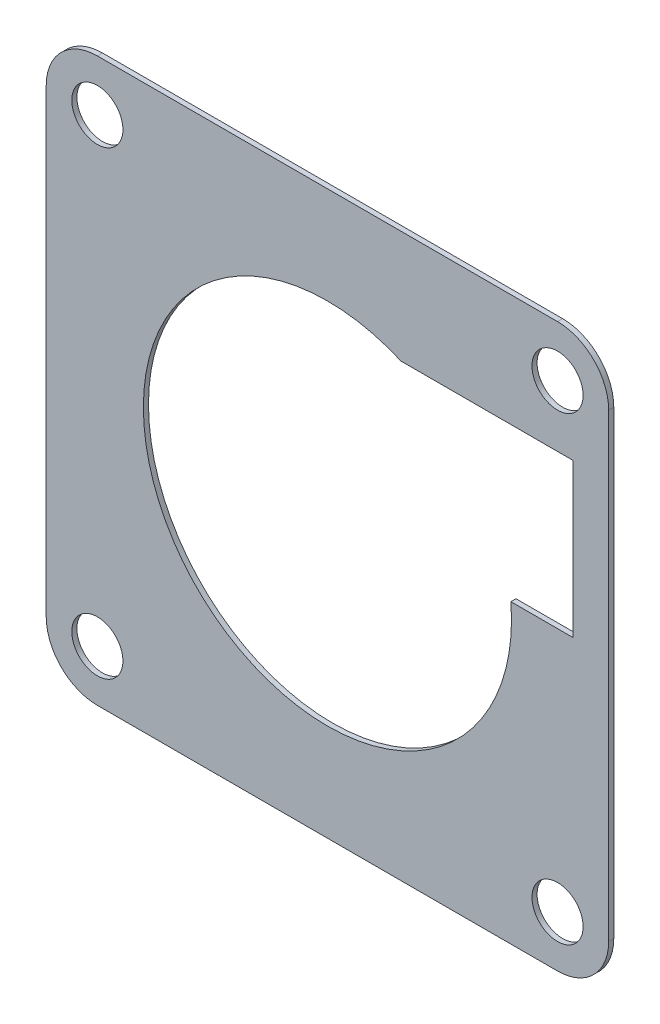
ISO-10303-21;
HEADER;
FILE_DESCRIPTION(('STEP AP214'),'2;1');
FILE_NAME('part.step','',(''),(''),'','','');
FILE_SCHEMA(('AUTOMOTIVE_DESIGN { 1 0 10303 214 1 1 1 1 }'));
ENDSEC;
DATA;
#1=APPLICATION_CONTEXT('core data for automotive mechanical design processes');
#2=APPLICATION_PROTOCOL_DEFINITION('international standard','automotive_design',2000,#1);
#3=PRODUCT_CONTEXT('',#1,'mechanical');
#4=PRODUCT('Part','Part','',(#3));
#5=PRODUCT_RELATED_PRODUCT_CATEGORY('part','',(#4));
#6=PRODUCT_DEFINITION_FORMATION('','',#4);
#7=PRODUCT_DEFINITION_CONTEXT('part definition',#1,'design');
#8=PRODUCT_DEFINITION('design','',#6,#7);
#9=PRODUCT_DEFINITION_SHAPE('','',#8);
#10=(LENGTH_UNIT() NAMED_UNIT(*) SI_UNIT(.MILLI.,.METRE.));
#11=(NAMED_UNIT(*) PLANE_ANGLE_UNIT() SI_UNIT($,.RADIAN.));
#12=(NAMED_UNIT(*) SI_UNIT($,.STERADIAN.) SOLID_ANGLE_UNIT());
#13=UNCERTAINTY_MEASURE_WITH_UNIT(LENGTH_MEASURE(1.E-05),#10,'distance_accuracy_value','');
#14=(GEOMETRIC_REPRESENTATION_CONTEXT(3) GLOBAL_UNCERTAINTY_ASSIGNED_CONTEXT((#13)) GLOBAL_UNIT_ASSIGNED_CONTEXT((#10,
#11,#12)) REPRESENTATION_CONTEXT('',''));
#15=CARTESIAN_POINT('',(0.,0.,0.));
#16=DIRECTION('',(0.,0.,1.));
#17=DIRECTION('',(1.,0.,0.));
#18=AXIS2_PLACEMENT_3D('',#15,#16,#17);
#19=CARTESIAN_POINT('',(-27.5,27.5,0.5));
#20=DIRECTION('',(1.,0.,0.));
#21=DIRECTION('',(0.,1.,0.));
#22=AXIS2_PLACEMENT_3D('',#19,#20,#21);
#23=PLANE('',#22);
#24=DIRECTION('',(0.,-1.,0.));
#25=VECTOR('',#24,1.);
#26=CARTESIAN_POINT('',(-27.5,27.5,0.5));
#27=LINE('',#26,#25);
#28=CARTESIAN_POINT('',(-27.5,22.5,0.5));
#29=VERTEX_POINT('',#28);
#30=CARTESIAN_POINT('',(-27.5,-22.5,0.5));
#31=VERTEX_POINT('',#30);
#32=EDGE_CURVE('E188',#29,#31,#27,.T.);
#33=ORIENTED_EDGE('',*,*,#32,.F.);
#34=DIRECTION('',(0.,0.,-1.));
#35=VECTOR('',#34,1.);
#36=CARTESIAN_POINT('',(-27.5,22.5,0.5));
#37=LINE('',#36,#35);
#38=CARTESIAN_POINT('',(-27.5,22.5,0.));
#39=VERTEX_POINT('',#38);
#40=EDGE_CURVE('E202',#29,#39,#37,.T.);
#41=ORIENTED_EDGE('',*,*,#40,.T.);
#42=DIRECTION('',(0.,-1.,0.));
#43=VECTOR('',#42,1.);
#44=CARTESIAN_POINT('',(-27.5,27.5,0.));
#45=LINE('',#44,#43);
#46=CARTESIAN_POINT('',(-27.5,-22.5,0.));
#47=VERTEX_POINT('',#46);
#48=EDGE_CURVE('E176',#39,#47,#45,.T.);
#49=ORIENTED_EDGE('',*,*,#48,.T.);
#50=DIRECTION('',(0.,0.,-1.));
#51=VECTOR('',#50,1.);
#52=CARTESIAN_POINT('',(-27.5,-22.5,0.5));
#53=LINE('',#52,#51);
#54=EDGE_CURVE('E200',#47,#31,#53,.F.);
#55=ORIENTED_EDGE('',*,*,#54,.T.);
#56=EDGE_LOOP('',(#33,#41,#49,#55));
#57=FACE_BOUND('',#56,.T.);
#58=ADVANCED_FACE('F29',(#57),#23,.F.);
#59=CARTESIAN_POINT('',(-27.5,-27.5,0.5));
#60=DIRECTION('',(0.,1.,0.));
#61=DIRECTION('',(0.,0.,1.));
#62=AXIS2_PLACEMENT_3D('',#59,#60,#61);
#63=PLANE('',#62);
#64=DIRECTION('',(1.,0.,0.));
#65=VECTOR('',#64,1.);
#66=CARTESIAN_POINT('',(-27.5,-27.5,0.));
#67=LINE('',#66,#65);
#68=CARTESIAN_POINT('',(-22.5,-27.5,0.));
#69=VERTEX_POINT('',#68);
#70=CARTESIAN_POINT('',(22.5,-27.5,0.));
#71=VERTEX_POINT('',#70);
#72=EDGE_CURVE('E179',#69,#71,#67,.T.);
#73=ORIENTED_EDGE('',*,*,#72,.T.);
#74=DIRECTION('',(0.,0.,-1.));
#75=VECTOR('',#74,1.);
#76=CARTESIAN_POINT('',(22.5,-27.5,0.5));
#77=LINE('',#76,#75);
#78=CARTESIAN_POINT('',(22.5,-27.5,0.5));
#79=VERTEX_POINT('',#78);
#80=EDGE_CURVE('E11',#71,#79,#77,.F.);
#81=ORIENTED_EDGE('',*,*,#80,.T.);
#82=DIRECTION('',(1.,0.,0.));
#83=VECTOR('',#82,1.);
#84=CARTESIAN_POINT('',(-27.5,-27.5,0.5));
#85=LINE('',#84,#83);
#86=CARTESIAN_POINT('',(-22.5,-27.5,0.5));
#87=VERTEX_POINT('',#86);
#88=EDGE_CURVE('E191',#87,#79,#85,.T.);
#89=ORIENTED_EDGE('',*,*,#88,.F.);
#90=DIRECTION('',(0.,0.,-1.));
#91=VECTOR('',#90,1.);
#92=CARTESIAN_POINT('',(-22.5,-27.5,0.5));
#93=LINE('',#92,#91);
#94=EDGE_CURVE('E36',#87,#69,#93,.T.);
#95=ORIENTED_EDGE('',*,*,#94,.T.);
#96=EDGE_LOOP('',(#73,#81,#89,#95));
#97=FACE_BOUND('',#96,.T.);
#98=ADVANCED_FACE('F235',(#97),#63,.F.);
#99=CARTESIAN_POINT('',(27.5,27.5,0.5));
#100=DIRECTION('',(-1.,0.,0.));
#101=DIRECTION('',(0.,-1.,0.));
#102=AXIS2_PLACEMENT_3D('',#99,#100,#101);
#103=PLANE('',#102);
#104=DIRECTION('',(0.,1.,0.));
#105=VECTOR('',#104,1.);
#106=CARTESIAN_POINT('',(27.5,27.5,0.));
#107=LINE('',#106,#105);
#108=CARTESIAN_POINT('',(27.5,-22.5,0.));
#109=VERTEX_POINT('',#108);
#110=CARTESIAN_POINT('',(27.5,22.5,0.));
#111=VERTEX_POINT('',#110);
#112=EDGE_CURVE('E182',#109,#111,#107,.T.);
#113=ORIENTED_EDGE('',*,*,#112,.T.);
#114=DIRECTION('',(0.,0.,-1.));
#115=VECTOR('',#114,1.);
#116=CARTESIAN_POINT('',(27.5,22.5,0.5));
#117=LINE('',#116,#115);
#118=CARTESIAN_POINT('',(27.5,22.5,0.5));
#119=VERTEX_POINT('',#118);
#120=EDGE_CURVE('E229',#111,#119,#117,.F.);
#121=ORIENTED_EDGE('',*,*,#120,.T.);
#122=DIRECTION('',(0.,1.,0.));
#123=VECTOR('',#122,1.);
#124=CARTESIAN_POINT('',(27.5,27.5,0.5));
#125=LINE('',#124,#123);
#126=CARTESIAN_POINT('',(27.5,-22.5,0.5));
#127=VERTEX_POINT('',#126);
#128=EDGE_CURVE('E194',#127,#119,#125,.T.);
#129=ORIENTED_EDGE('',*,*,#128,.F.);
#130=DIRECTION('',(0.,0.,-1.));
#131=VECTOR('',#130,1.);
#132=CARTESIAN_POINT('',(27.5,-22.5,0.5));
#133=LINE('',#132,#131);
#134=EDGE_CURVE('E226',#127,#109,#133,.T.);
#135=ORIENTED_EDGE('',*,*,#134,.T.);
#136=EDGE_LOOP('',(#113,#121,#129,#135));
#137=FACE_BOUND('',#136,.T.);
#138=ADVANCED_FACE('F249',(#137),#103,.F.);
#139=CARTESIAN_POINT('',(-27.5,27.5,0.5));
#140=DIRECTION('',(0.,-1.,0.));
#141=DIRECTION('',(0.,0.,-1.));
#142=AXIS2_PLACEMENT_3D('',#139,#140,#141);
#143=PLANE('',#142);
#144=DIRECTION('',(-1.,0.,0.));
#145=VECTOR('',#144,1.);
#146=CARTESIAN_POINT('',(-27.5,27.5,0.));
#147=LINE('',#146,#145);
#148=CARTESIAN_POINT('',(22.5,27.5,0.));
#149=VERTEX_POINT('',#148);
#150=CARTESIAN_POINT('',(-22.5,27.5,0.));
#151=VERTEX_POINT('',#150);
#152=EDGE_CURVE('E185',#149,#151,#147,.T.);
#153=ORIENTED_EDGE('',*,*,#152,.T.);
#154=DIRECTION('',(0.,0.,-1.));
#155=VECTOR('',#154,1.);
#156=CARTESIAN_POINT('',(-22.5,27.5,0.5));
#157=LINE('',#156,#155);
#158=CARTESIAN_POINT('',(-22.5,27.5,0.5));
#159=VERTEX_POINT('',#158);
#160=EDGE_CURVE('E216',#151,#159,#157,.F.);
#161=ORIENTED_EDGE('',*,*,#160,.T.);
#162=DIRECTION('',(-1.,0.,0.));
#163=VECTOR('',#162,1.);
#164=CARTESIAN_POINT('',(-27.5,27.5,0.5));
#165=LINE('',#164,#163);
#166=CARTESIAN_POINT('',(22.5,27.5,0.5));
#167=VERTEX_POINT('',#166);
#168=EDGE_CURVE('E197',#167,#159,#165,.T.);
#169=ORIENTED_EDGE('',*,*,#168,.F.);
#170=DIRECTION('',(0.,0.,-1.));
#171=VECTOR('',#170,1.);
#172=CARTESIAN_POINT('',(22.5,27.5,0.5));
#173=LINE('',#172,#171);
#174=EDGE_CURVE('E213',#167,#149,#173,.T.);
#175=ORIENTED_EDGE('',*,*,#174,.T.);
#176=EDGE_LOOP('',(#153,#161,#169,#175));
#177=FACE_BOUND('',#176,.T.);
#178=ADVANCED_FACE('F259',(#177),#143,.F.);
#179=CARTESIAN_POINT('',(-27.5,-27.5,0.5));
#180=DIRECTION('',(0.,0.,1.));
#181=DIRECTION('',(1.,0.,0.));
#182=AXIS2_PLACEMENT_3D('',#179,#180,#181);
#183=PLANE('',#182);
#184=CARTESIAN_POINT('',(0.,0.,0.5));
#185=DIRECTION('',(0.,0.,1.));
#186=DIRECTION('',(1.,0.,0.));
#187=AXIS2_PLACEMENT_3D('',#184,#185,#186);
#188=CIRCLE('',#187,18.);
#189=CARTESIAN_POINT('',(7.19374728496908,16.5,0.5));
#190=VERTEX_POINT('',#189);
#191=CARTESIAN_POINT('',(17.9373911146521,1.5,0.5));
#192=VERTEX_POINT('',#191);
#193=EDGE_CURVE('E43',#190,#192,#188,.T.);
#194=ORIENTED_EDGE('',*,*,#193,.F.);
#195=DIRECTION('',(-1.,0.,0.));
#196=VECTOR('',#195,1.);
#197=CARTESIAN_POINT('',(7.19374728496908,16.5,0.5));
#198=LINE('',#197,#196);
#199=CARTESIAN_POINT('',(24.,16.5,0.5));
#200=VERTEX_POINT('',#199);
#201=EDGE_CURVE('E134',#200,#190,#198,.T.);
#202=ORIENTED_EDGE('',*,*,#201,.F.);
#203=DIRECTION('',(0.,1.,0.));
#204=VECTOR('',#203,1.);
#205=CARTESIAN_POINT('',(24.,16.5,0.5));
#206=LINE('',#205,#204);
#207=CARTESIAN_POINT('',(24.,1.5,0.5));
#208=VERTEX_POINT('',#207);
#209=EDGE_CURVE('E118',#208,#200,#206,.T.);
#210=ORIENTED_EDGE('',*,*,#209,.F.);
#211=DIRECTION('',(1.,0.,0.));
#212=VECTOR('',#211,1.);
#213=CARTESIAN_POINT('',(24.,1.5,0.5));
#214=LINE('',#213,#212);
#215=EDGE_CURVE('E127',#192,#208,#214,.T.);
#216=ORIENTED_EDGE('',*,*,#215,.F.);
#217=EDGE_LOOP('',(#194,#202,#210,#216));
#218=FACE_BOUND('',#217,.T.);
#219=CARTESIAN_POINT('',(-22.5,-22.5,0.5));
#220=DIRECTION('',(0.,0.,1.));
#221=DIRECTION('',(-1.,0.,0.));
#222=AXIS2_PLACEMENT_3D('',#219,#220,#221);
#223=CIRCLE('',#222,2.5);
#224=CARTESIAN_POINT('',(-25.,-22.5,0.5));
#225=VERTEX_POINT('',#224);
#226=EDGE_CURVE('E150',#225,#225,#223,.T.);
#227=ORIENTED_EDGE('',*,*,#226,.F.);
#228=EDGE_LOOP('',(#227));
#229=FACE_BOUND('',#228,.T.);
#230=CARTESIAN_POINT('',(22.5,-22.5,0.5));
#231=DIRECTION('',(0.,0.,1.));
#232=DIRECTION('',(1.,0.,0.));
#233=AXIS2_PLACEMENT_3D('',#230,#231,#232);
#234=CIRCLE('',#233,2.5);
#235=CARTESIAN_POINT('',(25.,-22.5,0.5));
#236=VERTEX_POINT('',#235);
#237=EDGE_CURVE('E158',#236,#236,#234,.T.);
#238=ORIENTED_EDGE('',*,*,#237,.F.);
#239=EDGE_LOOP('',(#238));
#240=FACE_BOUND('',#239,.T.);
#241=CARTESIAN_POINT('',(22.5,22.5,0.5));
#242=DIRECTION('',(0.,0.,1.));
#243=DIRECTION('',(-1.,0.,0.));
#244=AXIS2_PLACEMENT_3D('',#241,#242,#243);
#245=CIRCLE('',#244,2.5);
#246=CARTESIAN_POINT('',(20.,22.5,0.5));
#247=VERTEX_POINT('',#246);
#248=EDGE_CURVE('E164',#247,#247,#245,.T.);
#249=ORIENTED_EDGE('',*,*,#248,.F.);
#250=EDGE_LOOP('',(#249));
#251=FACE_BOUND('',#250,.T.);
#252=CARTESIAN_POINT('',(-22.5,22.5,0.5));
#253=DIRECTION('',(0.,0.,1.));
#254=DIRECTION('',(1.,0.,0.));
#255=AXIS2_PLACEMENT_3D('',#252,#253,#254);
#256=CIRCLE('',#255,2.5);
#257=CARTESIAN_POINT('',(-20.,22.5,0.5));
#258=VERTEX_POINT('',#257);
#259=EDGE_CURVE('E170',#258,#258,#256,.T.);
#260=ORIENTED_EDGE('',*,*,#259,.F.);
#261=EDGE_LOOP('',(#260));
#262=FACE_BOUND('',#261,.T.);
#263=ORIENTED_EDGE('',*,*,#168,.T.);
#264=CARTESIAN_POINT('',(-22.5,22.5,0.5));
#265=DIRECTION('',(0.,0.,1.));
#266=DIRECTION('',(1.,0.,0.));
#267=AXIS2_PLACEMENT_3D('',#264,#265,#266);
#268=CIRCLE('',#267,5.);
#269=EDGE_CURVE('E224',#159,#29,#268,.T.);
#270=ORIENTED_EDGE('',*,*,#269,.T.);
#271=ORIENTED_EDGE('',*,*,#32,.T.);
#272=CARTESIAN_POINT('',(-22.5,-22.5,0.5));
#273=DIRECTION('',(0.,0.,1.));
#274=DIRECTION('',(1.,0.,0.));
#275=AXIS2_PLACEMENT_3D('',#272,#273,#274);
#276=CIRCLE('',#275,5.);
#277=EDGE_CURVE('E218',#31,#87,#276,.T.);
#278=ORIENTED_EDGE('',*,*,#277,.T.);
#279=ORIENTED_EDGE('',*,*,#88,.T.);
#280=CARTESIAN_POINT('',(22.5,-22.5,0.5));
#281=DIRECTION('',(0.,0.,1.));
#282=DIRECTION('',(1.,0.,0.));
#283=AXIS2_PLACEMENT_3D('',#280,#281,#282);
#284=CIRCLE('',#283,5.);
#285=EDGE_CURVE('E220',#79,#127,#284,.T.);
#286=ORIENTED_EDGE('',*,*,#285,.T.);
#287=ORIENTED_EDGE('',*,*,#128,.T.);
#288=CARTESIAN_POINT('',(22.5,22.5,0.5));
#289=DIRECTION('',(0.,0.,1.));
#290=DIRECTION('',(1.,0.,0.));
#291=AXIS2_PLACEMENT_3D('',#288,#289,#290);
#292=CIRCLE('',#291,5.);
#293=EDGE_CURVE('E222',#119,#167,#292,.T.);
#294=ORIENTED_EDGE('',*,*,#293,.T.);
#295=EDGE_LOOP('',(#263,#270,#271,#278,#279,#286,#287,#294));
#296=FACE_BOUND('',#295,.T.);
#297=ADVANCED_FACE('F131',(#218,#229,#240,#251,#262,#296),#183,.T.);
#298=CARTESIAN_POINT('',(-27.5,-27.5,0.));
#299=DIRECTION('',(0.,0.,1.));
#300=DIRECTION('',(1.,0.,0.));
#301=AXIS2_PLACEMENT_3D('',#298,#299,#300);
#302=PLANE('',#301);
#303=DIRECTION('',(-1.,0.,0.));
#304=VECTOR('',#303,1.);
#305=CARTESIAN_POINT('',(7.19374728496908,16.5,0.));
#306=LINE('',#305,#304);
#307=CARTESIAN_POINT('',(24.,16.5,0.));
#308=VERTEX_POINT('',#307);
#309=CARTESIAN_POINT('',(7.19374728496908,16.5,0.));
#310=VERTEX_POINT('',#309);
#311=EDGE_CURVE('E145',#308,#310,#306,.T.);
#312=ORIENTED_EDGE('',*,*,#311,.T.);
#313=CARTESIAN_POINT('',(0.,0.,0.));
#314=DIRECTION('',(0.,0.,1.));
#315=DIRECTION('',(1.,0.,0.));
#316=AXIS2_PLACEMENT_3D('',#313,#314,#315);
#317=CIRCLE('',#316,18.);
#318=CARTESIAN_POINT('',(17.9373911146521,1.5,0.));
#319=VERTEX_POINT('',#318);
#320=EDGE_CURVE('E136',#310,#319,#317,.T.);
#321=ORIENTED_EDGE('',*,*,#320,.T.);
#322=DIRECTION('',(1.,0.,0.));
#323=VECTOR('',#322,1.);
#324=CARTESIAN_POINT('',(24.,1.5,0.));
#325=LINE('',#324,#323);
#326=CARTESIAN_POINT('',(24.,1.50000000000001,0.));
#327=VERTEX_POINT('',#326);
#328=EDGE_CURVE('E142',#319,#327,#325,.T.);
#329=ORIENTED_EDGE('',*,*,#328,.T.);
#330=DIRECTION('',(0.,1.,0.));
#331=VECTOR('',#330,1.);
#332=CARTESIAN_POINT('',(24.,16.5,0.));
#333=LINE('',#332,#331);
#334=EDGE_CURVE('E51',#327,#308,#333,.T.);
#335=ORIENTED_EDGE('',*,*,#334,.T.);
#336=EDGE_LOOP('',(#312,#321,#329,#335));
#337=FACE_BOUND('',#336,.T.);
#338=CARTESIAN_POINT('',(-22.5,-22.5,0.));
#339=DIRECTION('',(0.,0.,1.));
#340=DIRECTION('',(-1.,0.,0.));
#341=AXIS2_PLACEMENT_3D('',#338,#339,#340);
#342=CIRCLE('',#341,2.5);
#343=CARTESIAN_POINT('',(-25.,-22.5,0.));
#344=VERTEX_POINT('',#343);
#345=EDGE_CURVE('E155',#344,#344,#342,.T.);
#346=ORIENTED_EDGE('',*,*,#345,.T.);
#347=EDGE_LOOP('',(#346));
#348=FACE_BOUND('',#347,.T.);
#349=CARTESIAN_POINT('',(22.5,-22.5,0.));
#350=DIRECTION('',(0.,0.,1.));
#351=DIRECTION('',(1.,0.,0.));
#352=AXIS2_PLACEMENT_3D('',#349,#350,#351);
#353=CIRCLE('',#352,2.5);
#354=CARTESIAN_POINT('',(25.,-22.5,0.));
#355=VERTEX_POINT('',#354);
#356=EDGE_CURVE('E161',#355,#355,#353,.T.);
#357=ORIENTED_EDGE('',*,*,#356,.T.);
#358=EDGE_LOOP('',(#357));
#359=FACE_BOUND('',#358,.T.);
#360=CARTESIAN_POINT('',(22.5,22.5,0.));
#361=DIRECTION('',(0.,0.,1.));
#362=DIRECTION('',(-1.,0.,0.));
#363=AXIS2_PLACEMENT_3D('',#360,#361,#362);
#364=CIRCLE('',#363,2.5);
#365=CARTESIAN_POINT('',(20.,22.5,0.));
#366=VERTEX_POINT('',#365);
#367=EDGE_CURVE('E167',#366,#366,#364,.T.);
#368=ORIENTED_EDGE('',*,*,#367,.T.);
#369=EDGE_LOOP('',(#368));
#370=FACE_BOUND('',#369,.T.);
#371=CARTESIAN_POINT('',(-22.5,22.5,0.));
#372=DIRECTION('',(0.,0.,1.));
#373=DIRECTION('',(1.,0.,0.));
#374=AXIS2_PLACEMENT_3D('',#371,#372,#373);
#375=CIRCLE('',#374,2.5);
#376=CARTESIAN_POINT('',(-20.,22.5,0.));
#377=VERTEX_POINT('',#376);
#378=EDGE_CURVE('E173',#377,#377,#375,.T.);
#379=ORIENTED_EDGE('',*,*,#378,.T.);
#380=EDGE_LOOP('',(#379));
#381=FACE_BOUND('',#380,.T.);
#382=ORIENTED_EDGE('',*,*,#48,.F.);
#383=CARTESIAN_POINT('',(-22.5,22.5,0.));
#384=DIRECTION('',(0.,0.,1.));
#385=DIRECTION('',(1.,0.,0.));
#386=AXIS2_PLACEMENT_3D('',#383,#384,#385);
#387=CIRCLE('',#386,5.);
#388=EDGE_CURVE('E211',#39,#151,#387,.F.);
#389=ORIENTED_EDGE('',*,*,#388,.T.);
#390=ORIENTED_EDGE('',*,*,#152,.F.);
#391=CARTESIAN_POINT('',(22.5,22.5,0.));
#392=DIRECTION('',(0.,0.,1.));
#393=DIRECTION('',(1.,0.,0.));
#394=AXIS2_PLACEMENT_3D('',#391,#392,#393);
#395=CIRCLE('',#394,5.);
#396=EDGE_CURVE('E209',#149,#111,#395,.F.);
#397=ORIENTED_EDGE('',*,*,#396,.T.);
#398=ORIENTED_EDGE('',*,*,#112,.F.);
#399=CARTESIAN_POINT('',(22.5,-22.5,0.));
#400=DIRECTION('',(0.,0.,1.));
#401=DIRECTION('',(1.,0.,0.));
#402=AXIS2_PLACEMENT_3D('',#399,#400,#401);
#403=CIRCLE('',#402,5.);
#404=EDGE_CURVE('E207',#109,#71,#403,.F.);
#405=ORIENTED_EDGE('',*,*,#404,.T.);
#406=ORIENTED_EDGE('',*,*,#72,.F.);
#407=CARTESIAN_POINT('',(-22.5,-22.5,0.));
#408=DIRECTION('',(0.,0.,1.));
#409=DIRECTION('',(1.,0.,0.));
#410=AXIS2_PLACEMENT_3D('',#407,#408,#409);
#411=CIRCLE('',#410,5.);
#412=EDGE_CURVE('E205',#69,#47,#411,.F.);
#413=ORIENTED_EDGE('',*,*,#412,.T.);
#414=EDGE_LOOP('',(#382,#389,#390,#397,#398,#405,#406,#413));
#415=FACE_BOUND('',#414,.T.);
#416=ADVANCED_FACE('F241',(#337,#348,#359,#370,#381,#415),#302,.F.);
#417=CARTESIAN_POINT('',(-22.5,22.5,0.5));
#418=DIRECTION('',(0.,0.,-1.));
#419=DIRECTION('',(-1.,0.,0.));
#420=AXIS2_PLACEMENT_3D('',#417,#418,#419);
#421=CYLINDRICAL_SURFACE('',#420,5.);
#422=ORIENTED_EDGE('',*,*,#269,.F.);
#423=ORIENTED_EDGE('',*,*,#160,.F.);
#424=ORIENTED_EDGE('',*,*,#388,.F.);
#425=ORIENTED_EDGE('',*,*,#40,.F.);
#426=EDGE_LOOP('',(#422,#423,#424,#425));
#427=FACE_BOUND('',#426,.T.);
#428=ADVANCED_FACE('F264',(#427),#421,.T.);
#429=CARTESIAN_POINT('',(22.5,22.5,0.5));
#430=DIRECTION('',(0.,0.,-1.));
#431=DIRECTION('',(-1.,0.,0.));
#432=AXIS2_PLACEMENT_3D('',#429,#430,#431);
#433=CYLINDRICAL_SURFACE('',#432,5.);
#434=ORIENTED_EDGE('',*,*,#293,.F.);
#435=ORIENTED_EDGE('',*,*,#120,.F.);
#436=ORIENTED_EDGE('',*,*,#396,.F.);
#437=ORIENTED_EDGE('',*,*,#174,.F.);
#438=EDGE_LOOP('',(#434,#435,#436,#437));
#439=FACE_BOUND('',#438,.T.);
#440=ADVANCED_FACE('F256',(#439),#433,.T.);
#441=CARTESIAN_POINT('',(22.5,-22.5,0.5));
#442=DIRECTION('',(0.,0.,-1.));
#443=DIRECTION('',(-1.,0.,0.));
#444=AXIS2_PLACEMENT_3D('',#441,#442,#443);
#445=CYLINDRICAL_SURFACE('',#444,5.);
#446=ORIENTED_EDGE('',*,*,#285,.F.);
#447=ORIENTED_EDGE('',*,*,#80,.F.);
#448=ORIENTED_EDGE('',*,*,#404,.F.);
#449=ORIENTED_EDGE('',*,*,#134,.F.);
#450=EDGE_LOOP('',(#446,#447,#448,#449));
#451=FACE_BOUND('',#450,.T.);
#452=ADVANCED_FACE('F246',(#451),#445,.T.);
#453=CARTESIAN_POINT('',(-22.5,-22.5,0.5));
#454=DIRECTION('',(0.,0.,-1.));
#455=DIRECTION('',(-1.,0.,0.));
#456=AXIS2_PLACEMENT_3D('',#453,#454,#455);
#457=CYLINDRICAL_SURFACE('',#456,5.);
#458=ORIENTED_EDGE('',*,*,#277,.F.);
#459=ORIENTED_EDGE('',*,*,#54,.F.);
#460=ORIENTED_EDGE('',*,*,#412,.F.);
#461=ORIENTED_EDGE('',*,*,#94,.F.);
#462=EDGE_LOOP('',(#458,#459,#460,#461));
#463=FACE_BOUND('',#462,.T.);
#464=ADVANCED_FACE('F268',(#463),#457,.T.);
#465=CARTESIAN_POINT('',(-22.5,22.5,0.));
#466=DIRECTION('',(0.,0.,1.));
#467=DIRECTION('',(1.,0.,0.));
#468=AXIS2_PLACEMENT_3D('',#465,#466,#467);
#469=CYLINDRICAL_SURFACE('',#468,2.5);
#470=ORIENTED_EDGE('',*,*,#378,.F.);
#471=EDGE_LOOP('',(#470));
#472=FACE_BOUND('',#471,.T.);
#473=ORIENTED_EDGE('',*,*,#259,.T.);
#474=EDGE_LOOP('',(#473));
#475=FACE_BOUND('',#474,.T.);
#476=ADVANCED_FACE('F270',(#472,#475),#469,.F.);
#477=CARTESIAN_POINT('',(22.5,22.5,0.));
#478=DIRECTION('',(0.,0.,1.));
#479=DIRECTION('',(1.,0.,0.));
#480=AXIS2_PLACEMENT_3D('',#477,#478,#479);
#481=CYLINDRICAL_SURFACE('',#480,2.5);
#482=ORIENTED_EDGE('',*,*,#367,.F.);
#483=EDGE_LOOP('',(#482));
#484=FACE_BOUND('',#483,.T.);
#485=ORIENTED_EDGE('',*,*,#248,.T.);
#486=EDGE_LOOP('',(#485));
#487=FACE_BOUND('',#486,.T.);
#488=ADVANCED_FACE('F276',(#484,#487),#481,.F.);
#489=CARTESIAN_POINT('',(22.5,-22.5,0.));
#490=DIRECTION('',(0.,0.,1.));
#491=DIRECTION('',(1.,0.,0.));
#492=AXIS2_PLACEMENT_3D('',#489,#490,#491);
#493=CYLINDRICAL_SURFACE('',#492,2.5);
#494=ORIENTED_EDGE('',*,*,#356,.F.);
#495=EDGE_LOOP('',(#494));
#496=FACE_BOUND('',#495,.T.);
#497=ORIENTED_EDGE('',*,*,#237,.T.);
#498=EDGE_LOOP('',(#497));
#499=FACE_BOUND('',#498,.T.);
#500=ADVANCED_FACE('F326',(#496,#499),#493,.F.);
#501=CARTESIAN_POINT('',(-22.5,-22.5,0.));
#502=DIRECTION('',(0.,0.,1.));
#503=DIRECTION('',(1.,0.,0.));
#504=AXIS2_PLACEMENT_3D('',#501,#502,#503);
#505=CYLINDRICAL_SURFACE('',#504,2.5);
#506=ORIENTED_EDGE('',*,*,#345,.F.);
#507=EDGE_LOOP('',(#506));
#508=FACE_BOUND('',#507,.T.);
#509=ORIENTED_EDGE('',*,*,#226,.T.);
#510=EDGE_LOOP('',(#509));
#511=FACE_BOUND('',#510,.T.);
#512=ADVANCED_FACE('F336',(#508,#511),#505,.F.);
#513=CARTESIAN_POINT('',(0.,0.,0.));
#514=DIRECTION('',(0.,0.,1.));
#515=DIRECTION('',(1.,0.,0.));
#516=AXIS2_PLACEMENT_3D('',#513,#514,#515);
#517=CYLINDRICAL_SURFACE('',#516,18.);
#518=ORIENTED_EDGE('',*,*,#193,.T.);
#519=DIRECTION('',(0.,0.,1.));
#520=VECTOR('',#519,1.);
#521=CARTESIAN_POINT('',(17.9373911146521,1.5,0.));
#522=LINE('',#521,#520);
#523=EDGE_CURVE('E124',#319,#192,#522,.T.);
#524=ORIENTED_EDGE('',*,*,#523,.F.);
#525=ORIENTED_EDGE('',*,*,#320,.F.);
#526=DIRECTION('',(0.,0.,1.));
#527=VECTOR('',#526,1.);
#528=CARTESIAN_POINT('',(7.19374728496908,16.5,0.));
#529=LINE('',#528,#527);
#530=EDGE_CURVE('E148',#310,#190,#529,.T.);
#531=ORIENTED_EDGE('',*,*,#530,.T.);
#532=EDGE_LOOP('',(#518,#524,#525,#531));
#533=FACE_BOUND('',#532,.T.);
#534=ADVANCED_FACE('F346',(#533),#517,.F.);
#535=CARTESIAN_POINT('',(7.19374728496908,16.5,0.));
#536=DIRECTION('',(0.,1.,0.));
#537=DIRECTION('',(-1.,0.,0.));
#538=AXIS2_PLACEMENT_3D('',#535,#536,#537);
#539=PLANE('',#538);
#540=ORIENTED_EDGE('',*,*,#201,.T.);
#541=ORIENTED_EDGE('',*,*,#530,.F.);
#542=ORIENTED_EDGE('',*,*,#311,.F.);
#543=DIRECTION('',(0.,0.,1.));
#544=VECTOR('',#543,1.);
#545=CARTESIAN_POINT('',(24.,16.5,0.));
#546=LINE('',#545,#544);
#547=EDGE_CURVE('E123',#308,#200,#546,.T.);
#548=ORIENTED_EDGE('',*,*,#547,.T.);
#549=EDGE_LOOP('',(#540,#541,#542,#548));
#550=FACE_BOUND('',#549,.T.);
#551=ADVANCED_FACE('F370',(#550),#539,.F.);
#552=CARTESIAN_POINT('',(24.,16.5,0.));
#553=DIRECTION('',(1.,0.,0.));
#554=DIRECTION('',(0.,1.,0.));
#555=AXIS2_PLACEMENT_3D('',#552,#553,#554);
#556=PLANE('',#555);
#557=ORIENTED_EDGE('',*,*,#209,.T.);
#558=ORIENTED_EDGE('',*,*,#547,.F.);
#559=ORIENTED_EDGE('',*,*,#334,.F.);
#560=DIRECTION('',(0.,0.,1.));
#561=VECTOR('',#560,1.);
#562=CARTESIAN_POINT('',(24.,1.5,0.));
#563=LINE('',#562,#561);
#564=EDGE_CURVE('E114',#327,#208,#563,.T.);
#565=ORIENTED_EDGE('',*,*,#564,.T.);
#566=EDGE_LOOP('',(#557,#558,#559,#565));
#567=FACE_BOUND('',#566,.T.);
#568=ADVANCED_FACE('F116',(#567),#556,.F.);
#569=CARTESIAN_POINT('',(24.,1.5,0.));
#570=DIRECTION('',(0.,-1.,0.));
#571=DIRECTION('',(1.,0.,0.));
#572=AXIS2_PLACEMENT_3D('',#569,#570,#571);
#573=PLANE('',#572);
#574=ORIENTED_EDGE('',*,*,#215,.T.);
#575=ORIENTED_EDGE('',*,*,#564,.F.);
#576=ORIENTED_EDGE('',*,*,#328,.F.);
#577=ORIENTED_EDGE('',*,*,#523,.T.);
#578=EDGE_LOOP('',(#574,#575,#576,#577));
#579=FACE_BOUND('',#578,.T.);
#580=ADVANCED_FACE('F128',(#579),#573,.F.);
#581=CLOSED_SHELL('',(#58,#98,#138,#178,#297,#416,#428,#440,#452,#464,#476,#488,#500,#512,#534,
#551,#568,#580));
#582=MANIFOLD_SOLID_BREP('B2',#581);
#583=ADVANCED_BREP_SHAPE_REPRESENTATION('',(#18,#582),#14);
#584=SHAPE_DEFINITION_REPRESENTATION(#9,#583);
ENDSEC;
END-ISO-10303-21;
